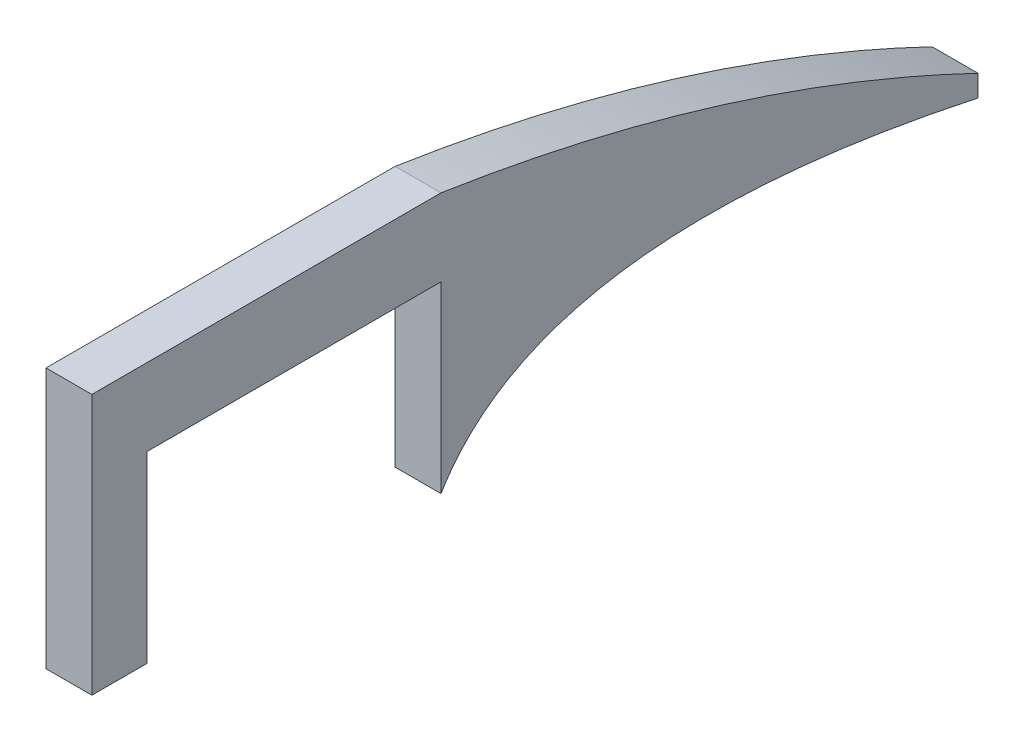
ISO-10303-21;
HEADER;
FILE_DESCRIPTION(('STEP AP214'),'2;1');
FILE_NAME('part.step','',(''),(''),'','','');
FILE_SCHEMA(('AUTOMOTIVE_DESIGN { 1 0 10303 214 1 1 1 1 }'));
ENDSEC;
DATA;
#1=APPLICATION_CONTEXT('core data for automotive mechanical design processes');
#2=APPLICATION_PROTOCOL_DEFINITION('international standard','automotive_design',2000,#1);
#3=PRODUCT_CONTEXT('',#1,'mechanical');
#4=PRODUCT('Part','Part','',(#3));
#5=PRODUCT_RELATED_PRODUCT_CATEGORY('part','',(#4));
#6=PRODUCT_DEFINITION_FORMATION('','',#4);
#7=PRODUCT_DEFINITION_CONTEXT('part definition',#1,'design');
#8=PRODUCT_DEFINITION('design','',#6,#7);
#9=PRODUCT_DEFINITION_SHAPE('','',#8);
#10=(LENGTH_UNIT() NAMED_UNIT(*) SI_UNIT(.MILLI.,.METRE.));
#11=(NAMED_UNIT(*) PLANE_ANGLE_UNIT() SI_UNIT($,.RADIAN.));
#12=(NAMED_UNIT(*) SI_UNIT($,.STERADIAN.) SOLID_ANGLE_UNIT());
#13=UNCERTAINTY_MEASURE_WITH_UNIT(LENGTH_MEASURE(1.E-05),#10,'distance_accuracy_value','');
#14=(GEOMETRIC_REPRESENTATION_CONTEXT(3) GLOBAL_UNCERTAINTY_ASSIGNED_CONTEXT((#13)) GLOBAL_UNIT_ASSIGNED_CONTEXT((#10,
#11,#12)) REPRESENTATION_CONTEXT('',''));
#15=CARTESIAN_POINT('',(0.,0.,0.));
#16=DIRECTION('',(0.,0.,1.));
#17=DIRECTION('',(1.,0.,0.));
#18=AXIS2_PLACEMENT_3D('',#15,#16,#17);
#19=CARTESIAN_POINT('',(6.35,18.034,13.0042321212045));
#20=CARTESIAN_POINT('',(6.35,12.003819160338,-26.3391604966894));
#21=CARTESIAN_POINT('',(6.35,-4.7981440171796,-61.341));
#22=B_SPLINE_CURVE_WITH_KNOTS('',2,(#19,#20,#21),.UNSPECIFIED.,.F.,.F.,(3,3),(0.,
0.877774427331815),.UNSPECIFIED.);
#23=DIRECTION('',(-1.,0.,0.));
#24=VECTOR('',#23,1.);
#25=SURFACE_OF_LINEAR_EXTRUSION('',#22,#24);
#26=CARTESIAN_POINT('',(0.,18.034,13.0042321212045));
#27=CARTESIAN_POINT('',(0.,12.003819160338,-26.3391604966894));
#28=CARTESIAN_POINT('',(0.,-4.7981440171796,-61.341));
#29=B_SPLINE_CURVE_WITH_KNOTS('',2,(#26,#27,#28),.UNSPECIFIED.,.F.,.F.,(3,3),(0.,
0.877774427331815),.UNSPECIFIED.);
#30=CARTESIAN_POINT('',(0.,18.034,13.0042321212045));
#31=VERTEX_POINT('',#30);
#32=CARTESIAN_POINT('',(0.,-4.7981440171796,-61.341));
#33=VERTEX_POINT('',#32);
#34=EDGE_CURVE('E177',#31,#33,#29,.T.);
#35=ORIENTED_EDGE('',*,*,#34,.F.);
#36=DIRECTION('',(-1.,0.,0.));
#37=VECTOR('',#36,1.);
#38=CARTESIAN_POINT('',(6.35,18.034,13.0042321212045));
#39=LINE('',#38,#37);
#40=CARTESIAN_POINT('',(6.35,18.034,13.0042321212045));
#41=VERTEX_POINT('',#40);
#42=EDGE_CURVE('E11',#41,#31,#39,.T.);
#43=ORIENTED_EDGE('',*,*,#42,.F.);
#44=CARTESIAN_POINT('',(6.35,-4.7981440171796,-61.341));
#45=VERTEX_POINT('',#44);
#46=EDGE_CURVE('E205',#41,#45,#22,.T.);
#47=ORIENTED_EDGE('',*,*,#46,.T.);
#48=DIRECTION('',(-1.,0.,0.));
#49=VECTOR('',#48,1.);
#50=CARTESIAN_POINT('',(6.35,-4.7981440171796,-61.341));
#51=LINE('',#50,#49);
#52=EDGE_CURVE('E50',#45,#33,#51,.T.);
#53=ORIENTED_EDGE('',*,*,#52,.T.);
#54=EDGE_LOOP('',(#35,#43,#47,#53));
#55=FACE_BOUND('',#54,.T.);
#56=ADVANCED_FACE('F33',(#55),#25,.T.);
#57=CARTESIAN_POINT('',(6.35,18.034,-99.6040933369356));
#58=DIRECTION('',(0.,-1.,0.));
#59=DIRECTION('',(0.,0.,-1.));
#60=AXIS2_PLACEMENT_3D('',#57,#58,#59);
#61=PLANE('',#60);
#62=DIRECTION('',(0.,0.,1.));
#63=VECTOR('',#62,1.);
#64=CARTESIAN_POINT('',(0.,18.034,-99.6040933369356));
#65=LINE('',#64,#63);
#66=CARTESIAN_POINT('',(0.,18.034,61.341));
#67=VERTEX_POINT('',#66);
#68=EDGE_CURVE('E171',#31,#67,#65,.T.);
#69=ORIENTED_EDGE('',*,*,#68,.T.);
#70=DIRECTION('',(-1.,0.,0.));
#71=VECTOR('',#70,1.);
#72=CARTESIAN_POINT('',(6.35,18.034,61.341));
#73=LINE('',#72,#71);
#74=CARTESIAN_POINT('',(6.35,18.034,61.341));
#75=VERTEX_POINT('',#74);
#76=EDGE_CURVE('E42',#75,#67,#73,.T.);
#77=ORIENTED_EDGE('',*,*,#76,.F.);
#78=DIRECTION('',(0.,0.,1.));
#79=VECTOR('',#78,1.);
#80=CARTESIAN_POINT('',(6.35,18.034,-99.6040933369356));
#81=LINE('',#80,#79);
#82=EDGE_CURVE('E222',#41,#75,#81,.T.);
#83=ORIENTED_EDGE('',*,*,#82,.F.);
#84=ORIENTED_EDGE('',*,*,#42,.T.);
#85=EDGE_LOOP('',(#69,#77,#83,#84));
#86=FACE_BOUND('',#85,.T.);
#87=ADVANCED_FACE('F162',(#86),#61,.F.);
#88=CARTESIAN_POINT('',(6.35,0.,61.341));
#89=DIRECTION('',(0.,0.,-1.));
#90=DIRECTION('',(-1.,0.,0.));
#91=AXIS2_PLACEMENT_3D('',#88,#89,#90);
#92=PLANE('',#91);
#93=DIRECTION('',(0.,-1.,0.));
#94=VECTOR('',#93,1.);
#95=CARTESIAN_POINT('',(0.,0.,61.341));
#96=LINE('',#95,#94);
#97=CARTESIAN_POINT('',(0.,-18.034,61.341));
#98=VERTEX_POINT('',#97);
#99=EDGE_CURVE('E176',#67,#98,#96,.T.);
#100=ORIENTED_EDGE('',*,*,#99,.T.);
#101=DIRECTION('',(-1.,0.,0.));
#102=VECTOR('',#101,1.);
#103=CARTESIAN_POINT('',(6.35,-18.034,61.341));
#104=LINE('',#103,#102);
#105=CARTESIAN_POINT('',(6.35,-18.034,61.341));
#106=VERTEX_POINT('',#105);
#107=EDGE_CURVE('E182',#106,#98,#104,.T.);
#108=ORIENTED_EDGE('',*,*,#107,.F.);
#109=DIRECTION('',(0.,-1.,0.));
#110=VECTOR('',#109,1.);
#111=CARTESIAN_POINT('',(6.35,0.,61.341));
#112=LINE('',#111,#110);
#113=EDGE_CURVE('E181',#75,#106,#112,.T.);
#114=ORIENTED_EDGE('',*,*,#113,.F.);
#115=ORIENTED_EDGE('',*,*,#76,.T.);
#116=EDGE_LOOP('',(#100,#108,#114,#115));
#117=FACE_BOUND('',#116,.T.);
#118=ADVANCED_FACE('F159',(#117),#92,.F.);
#119=CARTESIAN_POINT('',(6.35,-18.0340000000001,-99.6040933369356));
#120=DIRECTION('',(0.,1.,0.));
#121=DIRECTION('',(0.,0.,1.));
#122=AXIS2_PLACEMENT_3D('',#119,#120,#121);
#123=PLANE('',#122);
#124=DIRECTION('',(0.,0.,-1.));
#125=VECTOR('',#124,1.);
#126=CARTESIAN_POINT('',(0.,-18.0340000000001,-99.6040933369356));
#127=LINE('',#126,#125);
#128=CARTESIAN_POINT('',(0.,-18.034,53.721));
#129=VERTEX_POINT('',#128);
#130=EDGE_CURVE('E186',#98,#129,#127,.T.);
#131=ORIENTED_EDGE('',*,*,#130,.T.);
#132=DIRECTION('',(-1.,0.,0.));
#133=VECTOR('',#132,1.);
#134=CARTESIAN_POINT('',(6.35,-18.034,53.721));
#135=LINE('',#134,#133);
#136=CARTESIAN_POINT('',(6.35,-18.034,53.721));
#137=VERTEX_POINT('',#136);
#138=EDGE_CURVE('E212',#137,#129,#135,.T.);
#139=ORIENTED_EDGE('',*,*,#138,.F.);
#140=DIRECTION('',(0.,0.,-1.));
#141=VECTOR('',#140,1.);
#142=CARTESIAN_POINT('',(6.35,-18.0340000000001,-99.6040933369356));
#143=LINE('',#142,#141);
#144=EDGE_CURVE('E217',#106,#137,#143,.T.);
#145=ORIENTED_EDGE('',*,*,#144,.F.);
#146=ORIENTED_EDGE('',*,*,#107,.T.);
#147=EDGE_LOOP('',(#131,#139,#145,#146));
#148=FACE_BOUND('',#147,.T.);
#149=ADVANCED_FACE('F155',(#148),#123,.F.);
#150=CARTESIAN_POINT('',(6.35,0.,53.721));
#151=DIRECTION('',(0.,0.,1.));
#152=DIRECTION('',(1.,0.,0.));
#153=AXIS2_PLACEMENT_3D('',#150,#151,#152);
#154=PLANE('',#153);
#155=DIRECTION('',(0.,1.,0.));
#156=VECTOR('',#155,1.);
#157=CARTESIAN_POINT('',(0.,0.,53.721));
#158=LINE('',#157,#156);
#159=CARTESIAN_POINT('',(0.,7.36599999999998,53.721));
#160=VERTEX_POINT('',#159);
#161=EDGE_CURVE('E188',#129,#160,#158,.T.);
#162=ORIENTED_EDGE('',*,*,#161,.T.);
#163=DIRECTION('',(-1.,0.,0.));
#164=VECTOR('',#163,1.);
#165=CARTESIAN_POINT('',(6.35,7.36599999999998,53.721));
#166=LINE('',#165,#164);
#167=CARTESIAN_POINT('',(6.35,7.36599999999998,53.721));
#168=VERTEX_POINT('',#167);
#169=EDGE_CURVE('E209',#168,#160,#166,.T.);
#170=ORIENTED_EDGE('',*,*,#169,.F.);
#171=DIRECTION('',(0.,1.,0.));
#172=VECTOR('',#171,1.);
#173=CARTESIAN_POINT('',(6.35,0.,53.721));
#174=LINE('',#173,#172);
#175=EDGE_CURVE('E219',#137,#168,#174,.T.);
#176=ORIENTED_EDGE('',*,*,#175,.F.);
#177=ORIENTED_EDGE('',*,*,#138,.T.);
#178=EDGE_LOOP('',(#162,#170,#176,#177));
#179=FACE_BOUND('',#178,.T.);
#180=ADVANCED_FACE('F151',(#179),#154,.F.);
#181=CARTESIAN_POINT('',(6.35,7.36599999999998,-99.6040933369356));
#182=DIRECTION('',(0.,1.,0.));
#183=DIRECTION('',(0.,0.,1.));
#184=AXIS2_PLACEMENT_3D('',#181,#182,#183);
#185=PLANE('',#184);
#186=DIRECTION('',(0.,0.,-1.));
#187=VECTOR('',#186,1.);
#188=CARTESIAN_POINT('',(0.,7.36599999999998,-99.6040933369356));
#189=LINE('',#188,#187);
#190=CARTESIAN_POINT('',(0.,7.36599999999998,13.0042321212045));
#191=VERTEX_POINT('',#190);
#192=EDGE_CURVE('E192',#160,#191,#189,.T.);
#193=ORIENTED_EDGE('',*,*,#192,.T.);
#194=DIRECTION('',(-1.,0.,0.));
#195=VECTOR('',#194,1.);
#196=CARTESIAN_POINT('',(6.35,7.36599999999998,13.0042321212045));
#197=LINE('',#196,#195);
#198=CARTESIAN_POINT('',(6.35,7.36599999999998,13.0042321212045));
#199=VERTEX_POINT('',#198);
#200=EDGE_CURVE('E126',#199,#191,#197,.T.);
#201=ORIENTED_EDGE('',*,*,#200,.F.);
#202=DIRECTION('',(0.,0.,-1.));
#203=VECTOR('',#202,1.);
#204=CARTESIAN_POINT('',(6.35,7.36599999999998,-99.6040933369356));
#205=LINE('',#204,#203);
#206=EDGE_CURVE('E114',#168,#199,#205,.T.);
#207=ORIENTED_EDGE('',*,*,#206,.F.);
#208=ORIENTED_EDGE('',*,*,#169,.T.);
#209=EDGE_LOOP('',(#193,#201,#207,#208));
#210=FACE_BOUND('',#209,.T.);
#211=ADVANCED_FACE('F148',(#210),#185,.F.);
#212=CARTESIAN_POINT('',(6.35,0.,13.0042321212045));
#213=DIRECTION('',(0.,0.,-1.));
#214=DIRECTION('',(0.,1.,0.));
#215=AXIS2_PLACEMENT_3D('',#212,#213,#214);
#216=PLANE('',#215);
#217=DIRECTION('',(0.,-1.,0.));
#218=VECTOR('',#217,1.);
#219=CARTESIAN_POINT('',(0.,0.,13.0042321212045));
#220=LINE('',#219,#218);
#221=CARTESIAN_POINT('',(0.,-18.034,13.0042321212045));
#222=VERTEX_POINT('',#221);
#223=EDGE_CURVE('E123',#191,#222,#220,.T.);
#224=ORIENTED_EDGE('',*,*,#223,.T.);
#225=DIRECTION('',(-1.,0.,0.));
#226=VECTOR('',#225,1.);
#227=CARTESIAN_POINT('',(6.35,-18.034,13.0042321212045));
#228=LINE('',#227,#226);
#229=CARTESIAN_POINT('',(6.35,-18.034,13.0042321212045));
#230=VERTEX_POINT('',#229);
#231=EDGE_CURVE('E120',#230,#222,#228,.T.);
#232=ORIENTED_EDGE('',*,*,#231,.F.);
#233=DIRECTION('',(0.,-1.,0.));
#234=VECTOR('',#233,1.);
#235=CARTESIAN_POINT('',(6.35,0.,13.0042321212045));
#236=LINE('',#235,#234);
#237=EDGE_CURVE('E106',#199,#230,#236,.T.);
#238=ORIENTED_EDGE('',*,*,#237,.F.);
#239=ORIENTED_EDGE('',*,*,#200,.T.);
#240=EDGE_LOOP('',(#224,#232,#238,#239));
#241=FACE_BOUND('',#240,.T.);
#242=ADVANCED_FACE('F121',(#241),#216,.F.);
#243=CARTESIAN_POINT('',(6.35,-7.76774793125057,-61.341));
#244=CARTESIAN_POINT('',(6.35,5.27547670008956,-0.86335106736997));
#245=CARTESIAN_POINT('',(6.35,-18.034,13.0042321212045));
#246=B_SPLINE_CURVE_WITH_KNOTS('',2,(#243,#244,#245),.UNSPECIFIED.,.F.,.F.,(3,3),(0.,
0.897121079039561),.UNSPECIFIED.);
#247=DIRECTION('',(-1.,0.,0.));
#248=VECTOR('',#247,1.);
#249=SURFACE_OF_LINEAR_EXTRUSION('',#246,#248);
#250=CARTESIAN_POINT('',(0.,-7.76774793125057,-61.341));
#251=CARTESIAN_POINT('',(0.,5.27547670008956,-0.86335106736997));
#252=CARTESIAN_POINT('',(0.,-18.034,13.0042321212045));
#253=B_SPLINE_CURVE_WITH_KNOTS('',2,(#250,#251,#252),.UNSPECIFIED.,.F.,.F.,(3,3),(0.,
0.897121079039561),.UNSPECIFIED.);
#254=CARTESIAN_POINT('',(0.,-7.76774793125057,-61.341));
#255=VERTEX_POINT('',#254);
#256=EDGE_CURVE('E195',#255,#222,#253,.T.);
#257=ORIENTED_EDGE('',*,*,#256,.F.);
#258=DIRECTION('',(-1.,0.,0.));
#259=VECTOR('',#258,1.);
#260=CARTESIAN_POINT('',(6.35,-7.76774793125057,-61.341));
#261=LINE('',#260,#259);
#262=CARTESIAN_POINT('',(6.35,-7.76774793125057,-61.341));
#263=VERTEX_POINT('',#262);
#264=EDGE_CURVE('E78',#263,#255,#261,.T.);
#265=ORIENTED_EDGE('',*,*,#264,.F.);
#266=EDGE_CURVE('E112',#263,#230,#246,.T.);
#267=ORIENTED_EDGE('',*,*,#266,.T.);
#268=ORIENTED_EDGE('',*,*,#231,.T.);
#269=EDGE_LOOP('',(#257,#265,#267,#268));
#270=FACE_BOUND('',#269,.T.);
#271=ADVANCED_FACE('F128',(#270),#249,.T.);
#272=CARTESIAN_POINT('',(6.35,0.,-61.341));
#273=DIRECTION('',(0.,0.,-1.));
#274=DIRECTION('',(-1.,0.,0.));
#275=AXIS2_PLACEMENT_3D('',#272,#273,#274);
#276=PLANE('',#275);
#277=DIRECTION('',(0.,-1.,0.));
#278=VECTOR('',#277,1.);
#279=CARTESIAN_POINT('',(0.,0.,-61.341));
#280=LINE('',#279,#278);
#281=EDGE_CURVE('E199',#33,#255,#280,.T.);
#282=ORIENTED_EDGE('',*,*,#281,.F.);
#283=ORIENTED_EDGE('',*,*,#52,.F.);
#284=DIRECTION('',(0.,-1.,0.));
#285=VECTOR('',#284,1.);
#286=CARTESIAN_POINT('',(6.35,0.,-61.341));
#287=LINE('',#286,#285);
#288=EDGE_CURVE('E129',#45,#263,#287,.T.);
#289=ORIENTED_EDGE('',*,*,#288,.T.);
#290=ORIENTED_EDGE('',*,*,#264,.T.);
#291=EDGE_LOOP('',(#282,#283,#289,#290));
#292=FACE_BOUND('',#291,.T.);
#293=ADVANCED_FACE('F144',(#292),#276,.T.);
#294=CARTESIAN_POINT('',(6.35,0.,-99.6040933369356));
#295=DIRECTION('',(1.,0.,0.));
#296=DIRECTION('',(0.,0.,-1.));
#297=AXIS2_PLACEMENT_3D('',#294,#295,#296);
#298=PLANE('',#297);
#299=ORIENTED_EDGE('',*,*,#46,.F.);
#300=ORIENTED_EDGE('',*,*,#82,.T.);
#301=ORIENTED_EDGE('',*,*,#113,.T.);
#302=ORIENTED_EDGE('',*,*,#144,.T.);
#303=ORIENTED_EDGE('',*,*,#175,.T.);
#304=ORIENTED_EDGE('',*,*,#206,.T.);
#305=ORIENTED_EDGE('',*,*,#237,.T.);
#306=ORIENTED_EDGE('',*,*,#266,.F.);
#307=ORIENTED_EDGE('',*,*,#288,.F.);
#308=EDGE_LOOP('',(#299,#300,#301,#302,#303,#304,#305,#306,#307));
#309=FACE_BOUND('',#308,.T.);
#310=ADVANCED_FACE('F109',(#309),#298,.T.);
#311=CARTESIAN_POINT('',(0.,0.,-99.6040933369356));
#312=DIRECTION('',(1.,0.,0.));
#313=DIRECTION('',(0.,0.,-1.));
#314=AXIS2_PLACEMENT_3D('',#311,#312,#313);
#315=PLANE('',#314);
#316=ORIENTED_EDGE('',*,*,#34,.T.);
#317=ORIENTED_EDGE('',*,*,#281,.T.);
#318=ORIENTED_EDGE('',*,*,#256,.T.);
#319=ORIENTED_EDGE('',*,*,#223,.F.);
#320=ORIENTED_EDGE('',*,*,#192,.F.);
#321=ORIENTED_EDGE('',*,*,#161,.F.);
#322=ORIENTED_EDGE('',*,*,#130,.F.);
#323=ORIENTED_EDGE('',*,*,#99,.F.);
#324=ORIENTED_EDGE('',*,*,#68,.F.);
#325=EDGE_LOOP('',(#316,#317,#318,#319,#320,#321,#322,#323,#324));
#326=FACE_BOUND('',#325,.T.);
#327=ADVANCED_FACE('F184',(#326),#315,.F.);
#328=CLOSED_SHELL('',(#56,#87,#118,#149,#180,#211,#242,#271,#293,#310,#327));
#329=MANIFOLD_SOLID_BREP('B2',#328);
#330=ADVANCED_BREP_SHAPE_REPRESENTATION('',(#18,#329),#14);
#331=SHAPE_DEFINITION_REPRESENTATION(#9,#330);
ENDSEC;
END-ISO-10303-21;
